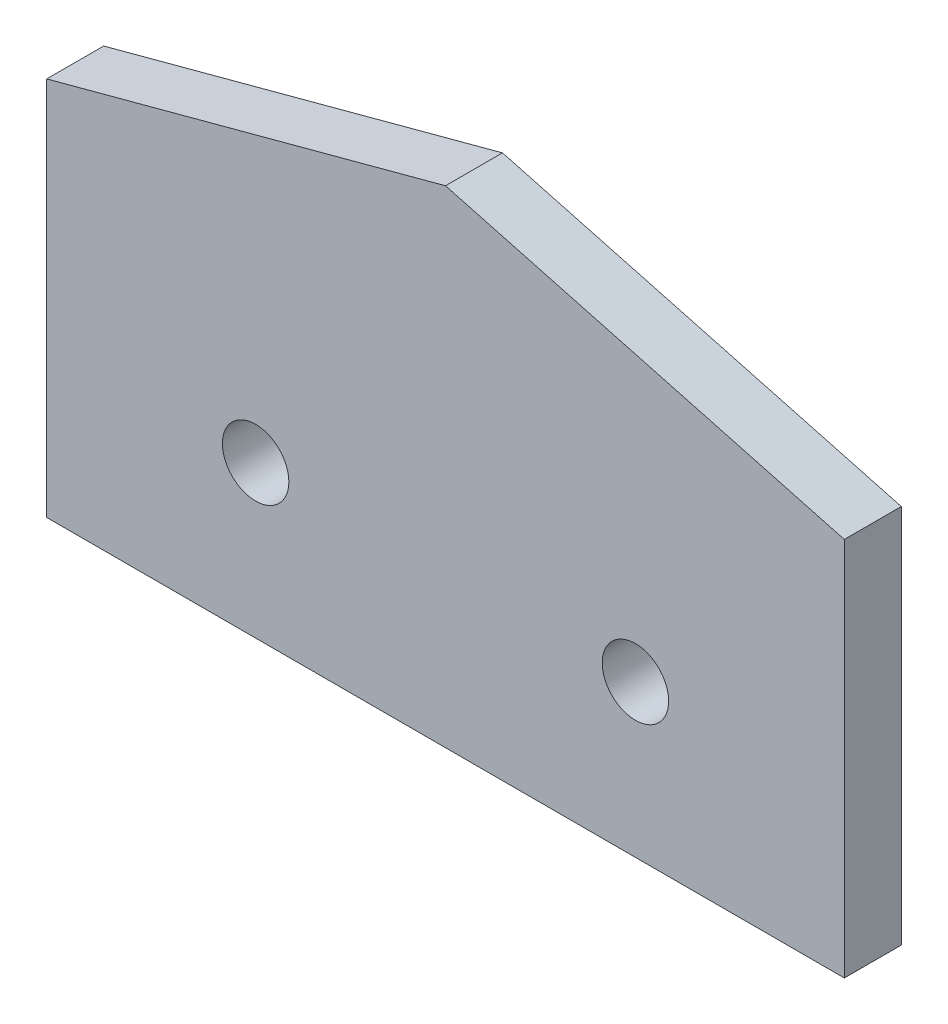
from build123d import *

# Parameters (mm, degrees)
SKETCH1_R      = 1.75
EXTRUDE1_DEPTH = 3


with BuildPart() as part:
    # Sketch1 → Extrude1 (new body)
    with BuildSketch(Plane.XY):
        Polygon((0, 0), (42, 0), (42, 20), (21, 25.626933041), (0, 20), align=None)
        with Locations((11, 8)):
            Circle(SKETCH1_R, mode=Mode.SUBTRACT)
        with Locations((31, 8)):
            Circle(SKETCH1_R, mode=Mode.SUBTRACT)
    extrude(amount=EXTRUDE1_DEPTH)


solid = part.part
